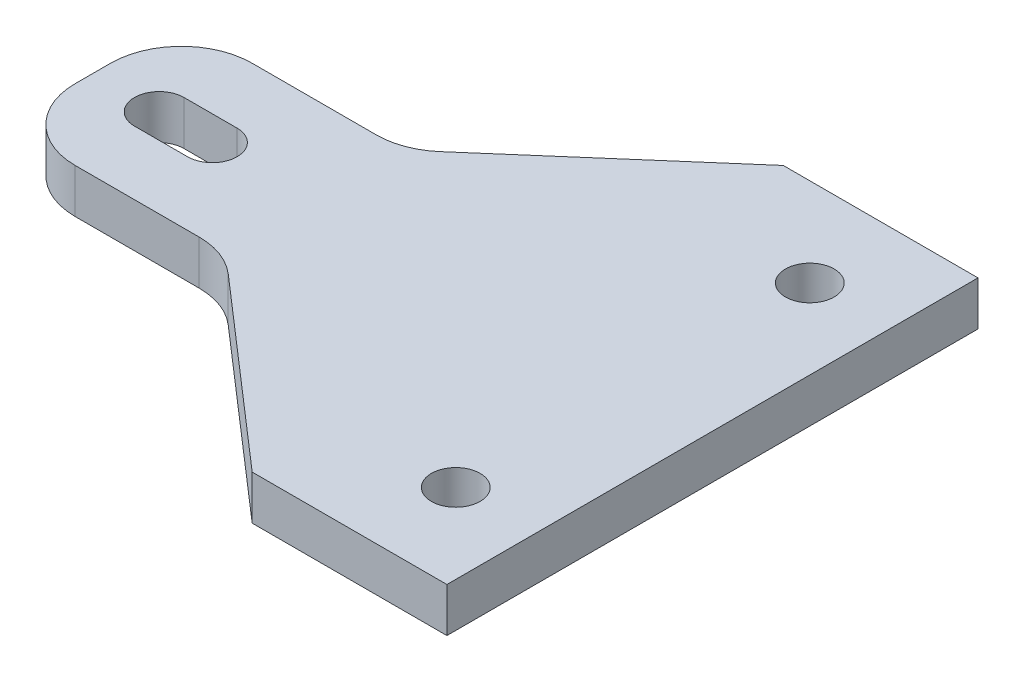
ISO-10303-21;
HEADER;
FILE_DESCRIPTION(('STEP AP214'),'2;1');
FILE_NAME('part.step','',(''),(''),'','','');
FILE_SCHEMA(('AUTOMOTIVE_DESIGN { 1 0 10303 214 1 1 1 1 }'));
ENDSEC;
DATA;
#1=APPLICATION_CONTEXT('core data for automotive mechanical design processes');
#2=APPLICATION_PROTOCOL_DEFINITION('international standard','automotive_design',2000,#1);
#3=PRODUCT_CONTEXT('',#1,'mechanical');
#4=PRODUCT('Part','Part','',(#3));
#5=PRODUCT_RELATED_PRODUCT_CATEGORY('part','',(#4));
#6=PRODUCT_DEFINITION_FORMATION('','',#4);
#7=PRODUCT_DEFINITION_CONTEXT('part definition',#1,'design');
#8=PRODUCT_DEFINITION('design','',#6,#7);
#9=PRODUCT_DEFINITION_SHAPE('','',#8);
#10=(LENGTH_UNIT() NAMED_UNIT(*) SI_UNIT(.MILLI.,.METRE.));
#11=(NAMED_UNIT(*) PLANE_ANGLE_UNIT() SI_UNIT($,.RADIAN.));
#12=(NAMED_UNIT(*) SI_UNIT($,.STERADIAN.) SOLID_ANGLE_UNIT());
#13=UNCERTAINTY_MEASURE_WITH_UNIT(LENGTH_MEASURE(1.E-05),#10,'distance_accuracy_value','');
#14=(GEOMETRIC_REPRESENTATION_CONTEXT(3) GLOBAL_UNCERTAINTY_ASSIGNED_CONTEXT((#13)) GLOBAL_UNIT_ASSIGNED_CONTEXT((#10,
#11,#12)) REPRESENTATION_CONTEXT('',''));
#15=CARTESIAN_POINT('',(0.,0.,0.));
#16=DIRECTION('',(0.,0.,1.));
#17=DIRECTION('',(1.,0.,0.));
#18=AXIS2_PLACEMENT_3D('',#15,#16,#17);
#19=CARTESIAN_POINT('',(0.,0.,0.));
#20=DIRECTION('',(0.,-1.,0.));
#21=DIRECTION('',(0.,0.,-1.));
#22=AXIS2_PLACEMENT_3D('',#19,#20,#21);
#23=PLANE('',#22);
#24=DIRECTION('',(-1.,0.,0.));
#25=VECTOR('',#24,1.);
#26=CARTESIAN_POINT('',(7.5,0.,-27.2));
#27=LINE('',#26,#25);
#28=CARTESIAN_POINT('',(13.5,0.,-27.2));
#29=VERTEX_POINT('',#28);
#30=CARTESIAN_POINT('',(7.5,0.,-27.2));
#31=VERTEX_POINT('',#30);
#32=EDGE_CURVE('E136',#29,#31,#27,.T.);
#33=ORIENTED_EDGE('',*,*,#32,.F.);
#34=CARTESIAN_POINT('',(13.5,0.,-30.));
#35=DIRECTION('',(0.,-1.,0.));
#36=DIRECTION('',(0.,0.,-1.));
#37=AXIS2_PLACEMENT_3D('',#34,#35,#36);
#38=CIRCLE('',#37,2.8);
#39=CARTESIAN_POINT('',(13.5,0.,-32.8));
#40=VERTEX_POINT('',#39);
#41=EDGE_CURVE('E206',#29,#40,#38,.F.);
#42=ORIENTED_EDGE('',*,*,#41,.T.);
#43=DIRECTION('',(1.,0.,0.));
#44=VECTOR('',#43,1.);
#45=CARTESIAN_POINT('',(7.5,0.,-32.8));
#46=LINE('',#45,#44);
#47=CARTESIAN_POINT('',(7.5,0.,-32.8));
#48=VERTEX_POINT('',#47);
#49=EDGE_CURVE('E209',#48,#40,#46,.T.);
#50=ORIENTED_EDGE('',*,*,#49,.F.);
#51=CARTESIAN_POINT('',(7.5,0.,-30.));
#52=DIRECTION('',(0.,-1.,0.));
#53=DIRECTION('',(0.,0.,-1.));
#54=AXIS2_PLACEMENT_3D('',#51,#52,#53);
#55=CIRCLE('',#54,2.8);
#56=EDGE_CURVE('E203',#48,#31,#55,.F.);
#57=ORIENTED_EDGE('',*,*,#56,.T.);
#58=EDGE_LOOP('',(#33,#42,#50,#57));
#59=FACE_BOUND('',#58,.T.);
#60=CARTESIAN_POINT('',(61.,0.,-10.));
#61=DIRECTION('',(0.,-1.,0.));
#62=DIRECTION('',(0.,0.,-1.));
#63=AXIS2_PLACEMENT_3D('',#60,#61,#62);
#64=CIRCLE('',#63,2.75000000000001);
#65=CARTESIAN_POINT('',(61.,0.,-12.75));
#66=VERTEX_POINT('',#65);
#67=EDGE_CURVE('E20',#66,#66,#64,.F.);
#68=ORIENTED_EDGE('',*,*,#67,.T.);
#69=EDGE_LOOP('',(#68));
#70=FACE_BOUND('',#69,.T.);
#71=CARTESIAN_POINT('',(61.,0.,-50.));
#72=DIRECTION('',(0.,-1.,0.));
#73=DIRECTION('',(0.,0.,-1.));
#74=AXIS2_PLACEMENT_3D('',#71,#72,#73);
#75=CIRCLE('',#74,2.75000000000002);
#76=CARTESIAN_POINT('',(61.,0.,-52.75));
#77=VERTEX_POINT('',#76);
#78=EDGE_CURVE('E121',#77,#77,#75,.F.);
#79=ORIENTED_EDGE('',*,*,#78,.T.);
#80=EDGE_LOOP('',(#79));
#81=FACE_BOUND('',#80,.T.);
#82=DIRECTION('',(-1.,0.,0.));
#83=VECTOR('',#82,1.);
#84=CARTESIAN_POINT('',(0.,0.,-20.));
#85=LINE('',#84,#83);
#86=CARTESIAN_POINT('',(22.0081994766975,0.,-20.));
#87=VERTEX_POINT('',#86);
#88=CARTESIAN_POINT('',(8.,0.,-20.));
#89=VERTEX_POINT('',#88);
#90=EDGE_CURVE('E146',#87,#89,#85,.T.);
#91=ORIENTED_EDGE('',*,*,#90,.T.);
#92=CARTESIAN_POINT('',(8.,0.,-28.));
#93=DIRECTION('',(0.,-1.,0.));
#94=DIRECTION('',(0.,0.,-1.));
#95=AXIS2_PLACEMENT_3D('',#92,#93,#94);
#96=CIRCLE('',#95,8.);
#97=CARTESIAN_POINT('',(0.,0.,-28.));
#98=VERTEX_POINT('',#97);
#99=EDGE_CURVE('E148',#98,#89,#96,.F.);
#100=ORIENTED_EDGE('',*,*,#99,.F.);
#101=DIRECTION('',(0.,0.,-1.));
#102=VECTOR('',#101,1.);
#103=CARTESIAN_POINT('',(0.,0.,0.));
#104=LINE('',#103,#102);
#105=CARTESIAN_POINT('',(0.,0.,-32.));
#106=VERTEX_POINT('',#105);
#107=EDGE_CURVE('E143',#98,#106,#104,.T.);
#108=ORIENTED_EDGE('',*,*,#107,.T.);
#109=CARTESIAN_POINT('',(8.,0.,-32.));
#110=DIRECTION('',(0.,-1.,0.));
#111=DIRECTION('',(0.,0.,-1.));
#112=AXIS2_PLACEMENT_3D('',#109,#110,#111);
#113=CIRCLE('',#112,8.);
#114=CARTESIAN_POINT('',(8.,0.,-40.));
#115=VERTEX_POINT('',#114);
#116=EDGE_CURVE('E135',#115,#106,#113,.F.);
#117=ORIENTED_EDGE('',*,*,#116,.F.);
#118=DIRECTION('',(1.,0.,0.));
#119=VECTOR('',#118,1.);
#120=CARTESIAN_POINT('',(25.,0.,-40.));
#121=LINE('',#120,#119);
#122=CARTESIAN_POINT('',(22.0081994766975,0.,-40.));
#123=VERTEX_POINT('',#122);
#124=EDGE_CURVE('E126',#115,#123,#121,.T.);
#125=ORIENTED_EDGE('',*,*,#124,.T.);
#126=CARTESIAN_POINT('',(22.0081994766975,0.,-48.));
#127=DIRECTION('',(0.,1.,0.));
#128=DIRECTION('',(0.,0.,1.));
#129=AXIS2_PLACEMENT_3D('',#126,#127,#128);
#130=CIRCLE('',#129,8.);
#131=CARTESIAN_POINT('',(27.2576291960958,0.,-41.963155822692));
#132=VERTEX_POINT('',#131);
#133=EDGE_CURVE('E110',#123,#132,#130,.T.);
#134=ORIENTED_EDGE('',*,*,#133,.T.);
#135=DIRECTION('',(0.754605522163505,0.,-0.656178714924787));
#136=VECTOR('',#135,1.);
#137=CARTESIAN_POINT('',(48.,0.,-60.));
#138=LINE('',#137,#136);
#139=CARTESIAN_POINT('',(48.,0.,-60.));
#140=VERTEX_POINT('',#139);
#141=EDGE_CURVE('E174',#132,#140,#138,.T.);
#142=ORIENTED_EDGE('',*,*,#141,.T.);
#143=DIRECTION('',(1.,0.,0.));
#144=VECTOR('',#143,1.);
#145=CARTESIAN_POINT('',(0.,0.,-60.));
#146=LINE('',#145,#144);
#147=CARTESIAN_POINT('',(70.,0.,-60.));
#148=VERTEX_POINT('',#147);
#149=EDGE_CURVE('E168',#140,#148,#146,.T.);
#150=ORIENTED_EDGE('',*,*,#149,.T.);
#151=DIRECTION('',(0.,0.,1.));
#152=VECTOR('',#151,1.);
#153=CARTESIAN_POINT('',(70.,0.,0.));
#154=LINE('',#153,#152);
#155=CARTESIAN_POINT('',(70.,0.,0.));
#156=VERTEX_POINT('',#155);
#157=EDGE_CURVE('E162',#148,#156,#154,.T.);
#158=ORIENTED_EDGE('',*,*,#157,.T.);
#159=DIRECTION('',(-1.,0.,0.));
#160=VECTOR('',#159,1.);
#161=CARTESIAN_POINT('',(0.,0.,0.));
#162=LINE('',#161,#160);
#163=CARTESIAN_POINT('',(48.,0.,0.));
#164=VERTEX_POINT('',#163);
#165=EDGE_CURVE('E156',#156,#164,#162,.T.);
#166=ORIENTED_EDGE('',*,*,#165,.T.);
#167=DIRECTION('',(-0.754605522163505,0.,-0.656178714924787));
#168=VECTOR('',#167,1.);
#169=CARTESIAN_POINT('',(25.,0.,-20.));
#170=LINE('',#169,#168);
#171=CARTESIAN_POINT('',(27.2576291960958,0.,-18.036844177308));
#172=VERTEX_POINT('',#171);
#173=EDGE_CURVE('E150',#164,#172,#170,.T.);
#174=ORIENTED_EDGE('',*,*,#173,.T.);
#175=CARTESIAN_POINT('',(22.0081994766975,0.,-12.));
#176=DIRECTION('',(0.,1.,0.));
#177=DIRECTION('',(0.,0.,1.));
#178=AXIS2_PLACEMENT_3D('',#175,#176,#177);
#179=CIRCLE('',#178,8.);
#180=EDGE_CURVE('E213',#172,#87,#179,.T.);
#181=ORIENTED_EDGE('',*,*,#180,.T.);
#182=EDGE_LOOP('',(#91,#100,#108,#117,#125,#134,#142,#150,#158,#166,#174,#181));
#183=FACE_BOUND('',#182,.T.);
#184=ADVANCED_FACE('F17',(#59,#70,#81,#183),#23,.T.);
#185=CARTESIAN_POINT('',(61.,5.,-10.));
#186=DIRECTION('',(0.,-1.,0.));
#187=DIRECTION('',(0.,0.,-1.));
#188=AXIS2_PLACEMENT_3D('',#185,#186,#187);
#189=CYLINDRICAL_SURFACE('',#188,2.75000000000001);
#190=ORIENTED_EDGE('',*,*,#67,.F.);
#191=EDGE_LOOP('',(#190));
#192=FACE_BOUND('',#191,.T.);
#193=CARTESIAN_POINT('',(61.,5.,-10.));
#194=DIRECTION('',(0.,-1.,0.));
#195=DIRECTION('',(0.,0.,-1.));
#196=AXIS2_PLACEMENT_3D('',#193,#194,#195);
#197=CIRCLE('',#196,2.75000000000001);
#198=CARTESIAN_POINT('',(61.,5.,-12.75));
#199=VERTEX_POINT('',#198);
#200=EDGE_CURVE('E200',#199,#199,#197,.F.);
#201=ORIENTED_EDGE('',*,*,#200,.T.);
#202=EDGE_LOOP('',(#201));
#203=FACE_BOUND('',#202,.T.);
#204=ADVANCED_FACE('F221',(#192,#203),#189,.F.);
#205=CARTESIAN_POINT('',(61.,5.,-50.));
#206=DIRECTION('',(0.,-1.,0.));
#207=DIRECTION('',(0.,0.,-1.));
#208=AXIS2_PLACEMENT_3D('',#205,#206,#207);
#209=CYLINDRICAL_SURFACE('',#208,2.75000000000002);
#210=ORIENTED_EDGE('',*,*,#78,.F.);
#211=EDGE_LOOP('',(#210));
#212=FACE_BOUND('',#211,.T.);
#213=CARTESIAN_POINT('',(61.,5.,-50.));
#214=DIRECTION('',(0.,-1.,0.));
#215=DIRECTION('',(0.,0.,-1.));
#216=AXIS2_PLACEMENT_3D('',#213,#214,#215);
#217=CIRCLE('',#216,2.75000000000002);
#218=CARTESIAN_POINT('',(61.,5.,-52.75));
#219=VERTEX_POINT('',#218);
#220=EDGE_CURVE('E197',#219,#219,#217,.F.);
#221=ORIENTED_EDGE('',*,*,#220,.T.);
#222=EDGE_LOOP('',(#221));
#223=FACE_BOUND('',#222,.T.);
#224=ADVANCED_FACE('F224',(#212,#223),#209,.F.);
#225=CARTESIAN_POINT('',(22.0081994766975,8.,-48.));
#226=DIRECTION('',(0.,1.,0.));
#227=DIRECTION('',(0.,0.,1.));
#228=AXIS2_PLACEMENT_3D('',#225,#226,#227);
#229=CYLINDRICAL_SURFACE('',#228,8.);
#230=DIRECTION('',(0.,1.,0.));
#231=VECTOR('',#230,1.);
#232=CARTESIAN_POINT('',(27.2576291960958,8.,-41.963155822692));
#233=LINE('',#232,#231);
#234=CARTESIAN_POINT('',(27.2576291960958,5.,-41.963155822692));
#235=VERTEX_POINT('',#234);
#236=EDGE_CURVE('E116',#235,#132,#233,.F.);
#237=ORIENTED_EDGE('',*,*,#236,.T.);
#238=ORIENTED_EDGE('',*,*,#133,.F.);
#239=DIRECTION('',(0.,1.,0.));
#240=VECTOR('',#239,1.);
#241=CARTESIAN_POINT('',(22.0081994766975,8.,-40.));
#242=LINE('',#241,#240);
#243=CARTESIAN_POINT('',(22.0081994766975,5.,-40.));
#244=VERTEX_POINT('',#243);
#245=EDGE_CURVE('E114',#123,#244,#242,.T.);
#246=ORIENTED_EDGE('',*,*,#245,.T.);
#247=CARTESIAN_POINT('',(22.0081994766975,5.,-48.));
#248=DIRECTION('',(0.,1.,0.));
#249=DIRECTION('',(0.,0.,1.));
#250=AXIS2_PLACEMENT_3D('',#247,#248,#249);
#251=CIRCLE('',#250,8.);
#252=EDGE_CURVE('E194',#244,#235,#251,.T.);
#253=ORIENTED_EDGE('',*,*,#252,.T.);
#254=EDGE_LOOP('',(#237,#238,#246,#253));
#255=FACE_BOUND('',#254,.T.);
#256=ADVANCED_FACE('F112',(#255),#229,.F.);
#257=CARTESIAN_POINT('',(48.,8.,-60.));
#258=DIRECTION('',(0.656178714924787,0.,0.754605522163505));
#259=DIRECTION('',(0.754605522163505,0.,-0.656178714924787));
#260=AXIS2_PLACEMENT_3D('',#257,#258,#259);
#261=PLANE('',#260);
#262=ORIENTED_EDGE('',*,*,#236,.F.);
#263=DIRECTION('',(0.754605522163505,0.,-0.656178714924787));
#264=VECTOR('',#263,1.);
#265=CARTESIAN_POINT('',(27.2576291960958,5.,-41.963155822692));
#266=LINE('',#265,#264);
#267=CARTESIAN_POINT('',(48.,5.,-60.));
#268=VERTEX_POINT('',#267);
#269=EDGE_CURVE('E196',#235,#268,#266,.T.);
#270=ORIENTED_EDGE('',*,*,#269,.T.);
#271=DIRECTION('',(0.,1.,0.));
#272=VECTOR('',#271,1.);
#273=CARTESIAN_POINT('',(48.,5.,-60.));
#274=LINE('',#273,#272);
#275=EDGE_CURVE('E171',#268,#140,#274,.F.);
#276=ORIENTED_EDGE('',*,*,#275,.T.);
#277=ORIENTED_EDGE('',*,*,#141,.F.);
#278=EDGE_LOOP('',(#262,#270,#276,#277));
#279=FACE_BOUND('',#278,.T.);
#280=ADVANCED_FACE('F289',(#279),#261,.F.);
#281=CARTESIAN_POINT('',(0.,5.,-60.));
#282=DIRECTION('',(0.,0.,1.));
#283=DIRECTION('',(1.,0.,0.));
#284=AXIS2_PLACEMENT_3D('',#281,#282,#283);
#285=PLANE('',#284);
#286=ORIENTED_EDGE('',*,*,#275,.F.);
#287=DIRECTION('',(1.,0.,0.));
#288=VECTOR('',#287,1.);
#289=CARTESIAN_POINT('',(0.,5.,-60.));
#290=LINE('',#289,#288);
#291=CARTESIAN_POINT('',(70.,5.,-60.));
#292=VERTEX_POINT('',#291);
#293=EDGE_CURVE('E464',#268,#292,#290,.T.);
#294=ORIENTED_EDGE('',*,*,#293,.T.);
#295=DIRECTION('',(0.,1.,0.));
#296=VECTOR('',#295,1.);
#297=CARTESIAN_POINT('',(70.,5.,-60.));
#298=LINE('',#297,#296);
#299=EDGE_CURVE('E165',#292,#148,#298,.F.);
#300=ORIENTED_EDGE('',*,*,#299,.T.);
#301=ORIENTED_EDGE('',*,*,#149,.F.);
#302=EDGE_LOOP('',(#286,#294,#300,#301));
#303=FACE_BOUND('',#302,.T.);
#304=ADVANCED_FACE('F285',(#303),#285,.F.);
#305=CARTESIAN_POINT('',(70.,5.,0.));
#306=DIRECTION('',(-1.,0.,0.));
#307=DIRECTION('',(0.,0.,1.));
#308=AXIS2_PLACEMENT_3D('',#305,#306,#307);
#309=PLANE('',#308);
#310=ORIENTED_EDGE('',*,*,#299,.F.);
#311=DIRECTION('',(0.,0.,-1.));
#312=VECTOR('',#311,1.);
#313=CARTESIAN_POINT('',(70.,5.,0.));
#314=LINE('',#313,#312);
#315=CARTESIAN_POINT('',(70.,5.,0.));
#316=VERTEX_POINT('',#315);
#317=EDGE_CURVE('E455',#292,#316,#314,.F.);
#318=ORIENTED_EDGE('',*,*,#317,.T.);
#319=DIRECTION('',(0.,1.,0.));
#320=VECTOR('',#319,1.);
#321=CARTESIAN_POINT('',(70.,5.,0.));
#322=LINE('',#321,#320);
#323=EDGE_CURVE('E159',#316,#156,#322,.F.);
#324=ORIENTED_EDGE('',*,*,#323,.T.);
#325=ORIENTED_EDGE('',*,*,#157,.F.);
#326=EDGE_LOOP('',(#310,#318,#324,#325));
#327=FACE_BOUND('',#326,.T.);
#328=ADVANCED_FACE('F281',(#327),#309,.F.);
#329=CARTESIAN_POINT('',(0.,5.,0.));
#330=DIRECTION('',(0.,0.,-1.));
#331=DIRECTION('',(-1.,0.,0.));
#332=AXIS2_PLACEMENT_3D('',#329,#330,#331);
#333=PLANE('',#332);
#334=DIRECTION('',(0.,1.,0.));
#335=VECTOR('',#334,1.);
#336=CARTESIAN_POINT('',(48.,8.,0.));
#337=LINE('',#336,#335);
#338=CARTESIAN_POINT('',(48.,5.,0.));
#339=VERTEX_POINT('',#338);
#340=EDGE_CURVE('E153',#339,#164,#337,.F.);
#341=ORIENTED_EDGE('',*,*,#340,.T.);
#342=ORIENTED_EDGE('',*,*,#165,.F.);
#343=ORIENTED_EDGE('',*,*,#323,.F.);
#344=DIRECTION('',(1.,0.,0.));
#345=VECTOR('',#344,1.);
#346=CARTESIAN_POINT('',(0.,5.,0.));
#347=LINE('',#346,#345);
#348=EDGE_CURVE('E452',#316,#339,#347,.F.);
#349=ORIENTED_EDGE('',*,*,#348,.T.);
#350=EDGE_LOOP('',(#341,#342,#343,#349));
#351=FACE_BOUND('',#350,.T.);
#352=ADVANCED_FACE('F277',(#351),#333,.F.);
#353=CARTESIAN_POINT('',(25.,8.,-20.));
#354=DIRECTION('',(0.656178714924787,0.,-0.754605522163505));
#355=DIRECTION('',(-0.754605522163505,0.,-0.656178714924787));
#356=AXIS2_PLACEMENT_3D('',#353,#354,#355);
#357=PLANE('',#356);
#358=DIRECTION('',(0.,1.,0.));
#359=VECTOR('',#358,1.);
#360=CARTESIAN_POINT('',(27.2576291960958,8.,-18.036844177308));
#361=LINE('',#360,#359);
#362=CARTESIAN_POINT('',(27.2576291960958,5.,-18.036844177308));
#363=VERTEX_POINT('',#362);
#364=EDGE_CURVE('E152',#363,#172,#361,.F.);
#365=ORIENTED_EDGE('',*,*,#364,.T.);
#366=ORIENTED_EDGE('',*,*,#173,.F.);
#367=ORIENTED_EDGE('',*,*,#340,.F.);
#368=DIRECTION('',(-0.754605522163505,0.,-0.656178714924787));
#369=VECTOR('',#368,1.);
#370=CARTESIAN_POINT('',(48.,5.,0.));
#371=LINE('',#370,#369);
#372=EDGE_CURVE('E193',#339,#363,#371,.T.);
#373=ORIENTED_EDGE('',*,*,#372,.T.);
#374=EDGE_LOOP('',(#365,#366,#367,#373));
#375=FACE_BOUND('',#374,.T.);
#376=ADVANCED_FACE('F273',(#375),#357,.F.);
#377=CARTESIAN_POINT('',(22.0081994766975,8.,-12.));
#378=DIRECTION('',(0.,1.,0.));
#379=DIRECTION('',(0.,0.,1.));
#380=AXIS2_PLACEMENT_3D('',#377,#378,#379);
#381=CYLINDRICAL_SURFACE('',#380,8.);
#382=DIRECTION('',(0.,1.,0.));
#383=VECTOR('',#382,1.);
#384=CARTESIAN_POINT('',(22.0081994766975,8.,-20.));
#385=LINE('',#384,#383);
#386=CARTESIAN_POINT('',(22.0081994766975,5.,-20.));
#387=VERTEX_POINT('',#386);
#388=EDGE_CURVE('E149',#387,#87,#385,.F.);
#389=ORIENTED_EDGE('',*,*,#388,.T.);
#390=ORIENTED_EDGE('',*,*,#180,.F.);
#391=ORIENTED_EDGE('',*,*,#364,.F.);
#392=CARTESIAN_POINT('',(22.0081994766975,5.,-12.));
#393=DIRECTION('',(0.,1.,0.));
#394=DIRECTION('',(0.,0.,1.));
#395=AXIS2_PLACEMENT_3D('',#392,#393,#394);
#396=CIRCLE('',#395,8.);
#397=EDGE_CURVE('E190',#363,#387,#396,.T.);
#398=ORIENTED_EDGE('',*,*,#397,.T.);
#399=EDGE_LOOP('',(#389,#390,#391,#398));
#400=FACE_BOUND('',#399,.T.);
#401=ADVANCED_FACE('F269',(#400),#381,.F.);
#402=CARTESIAN_POINT('',(0.,8.,-20.));
#403=DIRECTION('',(0.,0.,-1.));
#404=DIRECTION('',(-1.,0.,0.));
#405=AXIS2_PLACEMENT_3D('',#402,#403,#404);
#406=PLANE('',#405);
#407=DIRECTION('',(0.,-1.,0.));
#408=VECTOR('',#407,1.);
#409=CARTESIAN_POINT('',(8.,8.,-20.));
#410=LINE('',#409,#408);
#411=CARTESIAN_POINT('',(8.,5.,-20.));
#412=VERTEX_POINT('',#411);
#413=EDGE_CURVE('E212',#89,#412,#410,.F.);
#414=ORIENTED_EDGE('',*,*,#413,.F.);
#415=ORIENTED_EDGE('',*,*,#90,.F.);
#416=ORIENTED_EDGE('',*,*,#388,.F.);
#417=DIRECTION('',(1.,0.,0.));
#418=VECTOR('',#417,1.);
#419=CARTESIAN_POINT('',(0.,5.,-20.));
#420=LINE('',#419,#418);
#421=EDGE_CURVE('E189',#387,#412,#420,.F.);
#422=ORIENTED_EDGE('',*,*,#421,.T.);
#423=EDGE_LOOP('',(#414,#415,#416,#422));
#424=FACE_BOUND('',#423,.T.);
#425=ADVANCED_FACE('F265',(#424),#406,.F.);
#426=CARTESIAN_POINT('',(8.,8.,-28.));
#427=DIRECTION('',(0.,-1.,0.));
#428=DIRECTION('',(0.,0.,-1.));
#429=AXIS2_PLACEMENT_3D('',#426,#427,#428);
#430=CYLINDRICAL_SURFACE('',#429,8.);
#431=ORIENTED_EDGE('',*,*,#99,.T.);
#432=ORIENTED_EDGE('',*,*,#413,.T.);
#433=CARTESIAN_POINT('',(8.,5.,-28.));
#434=DIRECTION('',(0.,-1.,0.));
#435=DIRECTION('',(0.,0.,-1.));
#436=AXIS2_PLACEMENT_3D('',#433,#434,#435);
#437=CIRCLE('',#436,8.);
#438=CARTESIAN_POINT('',(0.,5.,-28.));
#439=VERTEX_POINT('',#438);
#440=EDGE_CURVE('E186',#412,#439,#437,.T.);
#441=ORIENTED_EDGE('',*,*,#440,.T.);
#442=DIRECTION('',(0.,1.,0.));
#443=VECTOR('',#442,1.);
#444=CARTESIAN_POINT('',(0.,5.,-28.));
#445=LINE('',#444,#443);
#446=EDGE_CURVE('E145',#439,#98,#445,.F.);
#447=ORIENTED_EDGE('',*,*,#446,.T.);
#448=EDGE_LOOP('',(#431,#432,#441,#447));
#449=FACE_BOUND('',#448,.T.);
#450=ADVANCED_FACE('F261',(#449),#430,.T.);
#451=CARTESIAN_POINT('',(0.,5.,0.));
#452=DIRECTION('',(1.,0.,0.));
#453=DIRECTION('',(0.,0.,-1.));
#454=AXIS2_PLACEMENT_3D('',#451,#452,#453);
#455=PLANE('',#454);
#456=DIRECTION('',(0.,-1.,0.));
#457=VECTOR('',#456,1.);
#458=CARTESIAN_POINT('',(0.,5.,-32.));
#459=LINE('',#458,#457);
#460=CARTESIAN_POINT('',(0.,5.,-32.));
#461=VERTEX_POINT('',#460);
#462=EDGE_CURVE('E131',#106,#461,#459,.F.);
#463=ORIENTED_EDGE('',*,*,#462,.F.);
#464=ORIENTED_EDGE('',*,*,#107,.F.);
#465=ORIENTED_EDGE('',*,*,#446,.F.);
#466=DIRECTION('',(0.,0.,-1.));
#467=VECTOR('',#466,1.);
#468=CARTESIAN_POINT('',(0.,5.,0.));
#469=LINE('',#468,#467);
#470=EDGE_CURVE('E185',#439,#461,#469,.T.);
#471=ORIENTED_EDGE('',*,*,#470,.T.);
#472=EDGE_LOOP('',(#463,#464,#465,#471));
#473=FACE_BOUND('',#472,.T.);
#474=ADVANCED_FACE('F257',(#473),#455,.F.);
#475=CARTESIAN_POINT('',(8.,5.,-32.));
#476=DIRECTION('',(0.,-1.,0.));
#477=DIRECTION('',(0.,0.,-1.));
#478=AXIS2_PLACEMENT_3D('',#475,#476,#477);
#479=CYLINDRICAL_SURFACE('',#478,8.);
#480=ORIENTED_EDGE('',*,*,#116,.T.);
#481=ORIENTED_EDGE('',*,*,#462,.T.);
#482=CARTESIAN_POINT('',(8.,5.,-32.));
#483=DIRECTION('',(0.,-1.,0.));
#484=DIRECTION('',(0.,0.,-1.));
#485=AXIS2_PLACEMENT_3D('',#482,#483,#484);
#486=CIRCLE('',#485,8.);
#487=CARTESIAN_POINT('',(8.,5.,-40.));
#488=VERTEX_POINT('',#487);
#489=EDGE_CURVE('E182',#461,#488,#486,.T.);
#490=ORIENTED_EDGE('',*,*,#489,.T.);
#491=DIRECTION('',(0.,1.,0.));
#492=VECTOR('',#491,1.);
#493=CARTESIAN_POINT('',(8.,8.,-40.));
#494=LINE('',#493,#492);
#495=EDGE_CURVE('E130',#488,#115,#494,.F.);
#496=ORIENTED_EDGE('',*,*,#495,.T.);
#497=EDGE_LOOP('',(#480,#481,#490,#496));
#498=FACE_BOUND('',#497,.T.);
#499=ADVANCED_FACE('F254',(#498),#479,.T.);
#500=CARTESIAN_POINT('',(25.,8.,-40.));
#501=DIRECTION('',(0.,0.,1.));
#502=DIRECTION('',(1.,0.,0.));
#503=AXIS2_PLACEMENT_3D('',#500,#501,#502);
#504=PLANE('',#503);
#505=ORIENTED_EDGE('',*,*,#495,.F.);
#506=DIRECTION('',(1.,0.,0.));
#507=VECTOR('',#506,1.);
#508=CARTESIAN_POINT('',(0.,5.,-40.));
#509=LINE('',#508,#507);
#510=EDGE_CURVE('E129',#488,#244,#509,.T.);
#511=ORIENTED_EDGE('',*,*,#510,.T.);
#512=ORIENTED_EDGE('',*,*,#245,.F.);
#513=ORIENTED_EDGE('',*,*,#124,.F.);
#514=EDGE_LOOP('',(#505,#511,#512,#513));
#515=FACE_BOUND('',#514,.T.);
#516=ADVANCED_FACE('F125',(#515),#504,.F.);
#517=CARTESIAN_POINT('',(7.5,5.,-27.2));
#518=DIRECTION('',(0.,0.,-1.));
#519=DIRECTION('',(-1.,0.,0.));
#520=AXIS2_PLACEMENT_3D('',#517,#518,#519);
#521=PLANE('',#520);
#522=DIRECTION('',(1.,0.,0.));
#523=VECTOR('',#522,1.);
#524=CARTESIAN_POINT('',(0.,5.,-27.2));
#525=LINE('',#524,#523);
#526=CARTESIAN_POINT('',(7.5,5.,-27.2));
#527=VERTEX_POINT('',#526);
#528=CARTESIAN_POINT('',(13.5,5.,-27.2));
#529=VERTEX_POINT('',#528);
#530=EDGE_CURVE('E181',#527,#529,#525,.T.);
#531=ORIENTED_EDGE('',*,*,#530,.T.);
#532=DIRECTION('',(0.,-1.,0.));
#533=VECTOR('',#532,1.);
#534=CARTESIAN_POINT('',(13.5,5.,-27.2));
#535=LINE('',#534,#533);
#536=EDGE_CURVE('E138',#529,#29,#535,.T.);
#537=ORIENTED_EDGE('',*,*,#536,.T.);
#538=ORIENTED_EDGE('',*,*,#32,.T.);
#539=DIRECTION('',(0.,-1.,0.));
#540=VECTOR('',#539,1.);
#541=CARTESIAN_POINT('',(7.5,5.,-27.2));
#542=LINE('',#541,#540);
#543=EDGE_CURVE('E479',#31,#527,#542,.F.);
#544=ORIENTED_EDGE('',*,*,#543,.T.);
#545=EDGE_LOOP('',(#531,#537,#538,#544));
#546=FACE_BOUND('',#545,.T.);
#547=ADVANCED_FACE('F247',(#546),#521,.T.);
#548=CARTESIAN_POINT('',(13.5,5.,-30.));
#549=DIRECTION('',(0.,-1.,0.));
#550=DIRECTION('',(0.,0.,-1.));
#551=AXIS2_PLACEMENT_3D('',#548,#549,#550);
#552=CYLINDRICAL_SURFACE('',#551,2.8);
#553=ORIENTED_EDGE('',*,*,#536,.F.);
#554=CARTESIAN_POINT('',(13.5,5.,-30.));
#555=DIRECTION('',(0.,-1.,0.));
#556=DIRECTION('',(0.,0.,-1.));
#557=AXIS2_PLACEMENT_3D('',#554,#555,#556);
#558=CIRCLE('',#557,2.8);
#559=CARTESIAN_POINT('',(13.5,5.,-32.8));
#560=VERTEX_POINT('',#559);
#561=EDGE_CURVE('E178',#529,#560,#558,.F.);
#562=ORIENTED_EDGE('',*,*,#561,.T.);
#563=DIRECTION('',(0.,1.,0.));
#564=VECTOR('',#563,1.);
#565=CARTESIAN_POINT('',(13.5,5.,-32.8));
#566=LINE('',#565,#564);
#567=EDGE_CURVE('E434',#40,#560,#566,.T.);
#568=ORIENTED_EDGE('',*,*,#567,.F.);
#569=ORIENTED_EDGE('',*,*,#41,.F.);
#570=EDGE_LOOP('',(#553,#562,#568,#569));
#571=FACE_BOUND('',#570,.T.);
#572=ADVANCED_FACE('F243',(#571),#552,.F.);
#573=CARTESIAN_POINT('',(7.5,5.,-32.8));
#574=DIRECTION('',(0.,0.,1.));
#575=DIRECTION('',(1.,0.,0.));
#576=AXIS2_PLACEMENT_3D('',#573,#574,#575);
#577=PLANE('',#576);
#578=DIRECTION('',(1.,0.,0.));
#579=VECTOR('',#578,1.);
#580=CARTESIAN_POINT('',(0.,5.,-32.8));
#581=LINE('',#580,#579);
#582=CARTESIAN_POINT('',(7.5,5.,-32.8));
#583=VERTEX_POINT('',#582);
#584=EDGE_CURVE('E26',#560,#583,#581,.F.);
#585=ORIENTED_EDGE('',*,*,#584,.T.);
#586=DIRECTION('',(0.,-1.,0.));
#587=VECTOR('',#586,1.);
#588=CARTESIAN_POINT('',(7.5,5.,-32.8));
#589=LINE('',#588,#587);
#590=EDGE_CURVE('E34',#583,#48,#589,.T.);
#591=ORIENTED_EDGE('',*,*,#590,.T.);
#592=ORIENTED_EDGE('',*,*,#49,.T.);
#593=ORIENTED_EDGE('',*,*,#567,.T.);
#594=EDGE_LOOP('',(#585,#591,#592,#593));
#595=FACE_BOUND('',#594,.T.);
#596=ADVANCED_FACE('F236',(#595),#577,.T.);
#597=CARTESIAN_POINT('',(7.5,5.,-30.));
#598=DIRECTION('',(0.,-1.,0.));
#599=DIRECTION('',(0.,0.,-1.));
#600=AXIS2_PLACEMENT_3D('',#597,#598,#599);
#601=CYLINDRICAL_SURFACE('',#600,2.8);
#602=ORIENTED_EDGE('',*,*,#590,.F.);
#603=CARTESIAN_POINT('',(7.5,5.,-30.));
#604=DIRECTION('',(0.,-1.,0.));
#605=DIRECTION('',(0.,0.,-1.));
#606=AXIS2_PLACEMENT_3D('',#603,#604,#605);
#607=CIRCLE('',#606,2.8);
#608=EDGE_CURVE('E11',#583,#527,#607,.F.);
#609=ORIENTED_EDGE('',*,*,#608,.T.);
#610=ORIENTED_EDGE('',*,*,#543,.F.);
#611=ORIENTED_EDGE('',*,*,#56,.F.);
#612=EDGE_LOOP('',(#602,#609,#610,#611));
#613=FACE_BOUND('',#612,.T.);
#614=ADVANCED_FACE('F229',(#613),#601,.F.);
#615=CARTESIAN_POINT('',(0.,5.,0.));
#616=DIRECTION('',(0.,-1.,0.));
#617=DIRECTION('',(0.,0.,-1.));
#618=AXIS2_PLACEMENT_3D('',#615,#616,#617);
#619=PLANE('',#618);
#620=ORIENTED_EDGE('',*,*,#584,.F.);
#621=ORIENTED_EDGE('',*,*,#561,.F.);
#622=ORIENTED_EDGE('',*,*,#530,.F.);
#623=ORIENTED_EDGE('',*,*,#608,.F.);
#624=EDGE_LOOP('',(#620,#621,#622,#623));
#625=FACE_BOUND('',#624,.T.);
#626=ORIENTED_EDGE('',*,*,#489,.F.);
#627=ORIENTED_EDGE('',*,*,#470,.F.);
#628=ORIENTED_EDGE('',*,*,#440,.F.);
#629=ORIENTED_EDGE('',*,*,#421,.F.);
#630=ORIENTED_EDGE('',*,*,#397,.F.);
#631=ORIENTED_EDGE('',*,*,#372,.F.);
#632=ORIENTED_EDGE('',*,*,#348,.F.);
#633=ORIENTED_EDGE('',*,*,#317,.F.);
#634=ORIENTED_EDGE('',*,*,#293,.F.);
#635=ORIENTED_EDGE('',*,*,#269,.F.);
#636=ORIENTED_EDGE('',*,*,#252,.F.);
#637=ORIENTED_EDGE('',*,*,#510,.F.);
#638=EDGE_LOOP('',(#626,#627,#628,#629,#630,#631,#632,#633,#634,#635,#636,#637));
#639=FACE_BOUND('',#638,.T.);
#640=ORIENTED_EDGE('',*,*,#220,.F.);
#641=EDGE_LOOP('',(#640));
#642=FACE_BOUND('',#641,.T.);
#643=ORIENTED_EDGE('',*,*,#200,.F.);
#644=EDGE_LOOP('',(#643));
#645=FACE_BOUND('',#644,.T.);
#646=ADVANCED_FACE('F227',(#625,#639,#642,#645),#619,.F.);
#647=CLOSED_SHELL('',(#184,#204,#224,#256,#280,#304,#328,#352,#376,#401,#425,#450,#474,#499,
#516,#547,#572,#596,#614,#646));
#648=MANIFOLD_SOLID_BREP('B1',#647);
#649=ADVANCED_BREP_SHAPE_REPRESENTATION('',(#18,#648),#14);
#650=SHAPE_DEFINITION_REPRESENTATION(#9,#649);
ENDSEC;
END-ISO-10303-21;
